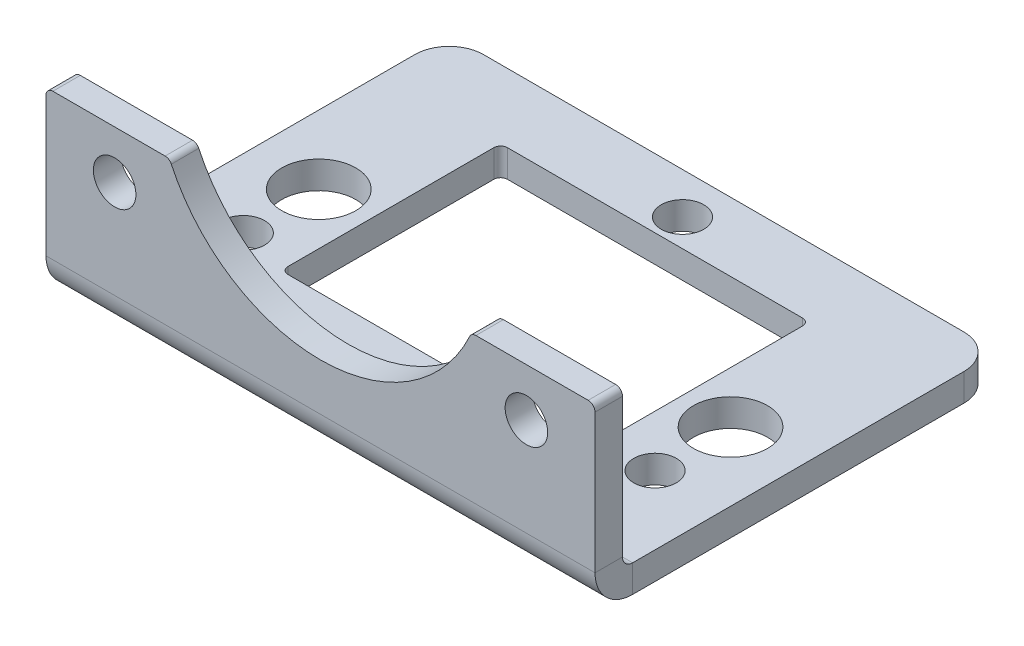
ISO-10303-21;
HEADER;
FILE_DESCRIPTION(('STEP AP214'),'2;1');
FILE_NAME('part.step','',(''),(''),'','','');
FILE_SCHEMA(('AUTOMOTIVE_DESIGN { 1 0 10303 214 1 1 1 1 }'));
ENDSEC;
DATA;
#1=APPLICATION_CONTEXT('core data for automotive mechanical design processes');
#2=APPLICATION_PROTOCOL_DEFINITION('international standard','automotive_design',2000,#1);
#3=PRODUCT_CONTEXT('',#1,'mechanical');
#4=PRODUCT('Part','Part','',(#3));
#5=PRODUCT_RELATED_PRODUCT_CATEGORY('part','',(#4));
#6=PRODUCT_DEFINITION_FORMATION('','',#4);
#7=PRODUCT_DEFINITION_CONTEXT('part definition',#1,'design');
#8=PRODUCT_DEFINITION('design','',#6,#7);
#9=PRODUCT_DEFINITION_SHAPE('','',#8);
#10=(LENGTH_UNIT() NAMED_UNIT(*) SI_UNIT(.MILLI.,.METRE.));
#11=(NAMED_UNIT(*) PLANE_ANGLE_UNIT() SI_UNIT($,.RADIAN.));
#12=(NAMED_UNIT(*) SI_UNIT($,.STERADIAN.) SOLID_ANGLE_UNIT());
#13=UNCERTAINTY_MEASURE_WITH_UNIT(LENGTH_MEASURE(1.E-05),#10,'distance_accuracy_value','');
#14=(GEOMETRIC_REPRESENTATION_CONTEXT(3) GLOBAL_UNCERTAINTY_ASSIGNED_CONTEXT((#13)) GLOBAL_UNIT_ASSIGNED_CONTEXT((#10,
#11,#12)) REPRESENTATION_CONTEXT('',''));
#15=CARTESIAN_POINT('',(0.,0.,0.));
#16=DIRECTION('',(0.,0.,1.));
#17=DIRECTION('',(1.,0.,0.));
#18=AXIS2_PLACEMENT_3D('',#15,#16,#17);
#19=CARTESIAN_POINT('',(-20.,-2.62732245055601,-10.627322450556));
#20=DIRECTION('',(-1.,0.,0.));
#21=DIRECTION('',(0.,1.,0.));
#22=AXIS2_PLACEMENT_3D('',#19,#20,#21);
#23=PLANE('',#22);
#24=DIRECTION('',(0.,1.,0.));
#25=VECTOR('',#24,1.);
#26=CARTESIAN_POINT('',(-20.,-2.62732245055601,-12.627322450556));
#27=LINE('',#26,#25);
#28=CARTESIAN_POINT('',(-20.,0.736600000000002,-12.627322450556));
#29=VERTEX_POINT('',#28);
#30=CARTESIAN_POINT('',(-20.,10.872677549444,-12.627322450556));
#31=VERTEX_POINT('',#30);
#32=EDGE_CURVE('E66',#29,#31,#27,.T.);
#33=ORIENTED_EDGE('',*,*,#32,.F.);
#34=DIRECTION('',(0.,0.,1.));
#35=VECTOR('',#34,1.);
#36=CARTESIAN_POINT('',(-20.,0.736600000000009,-10.627322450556));
#37=LINE('',#36,#35);
#38=CARTESIAN_POINT('',(-20.,0.736600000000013,-10.627322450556));
#39=VERTEX_POINT('',#38);
#40=EDGE_CURVE('E202',#29,#39,#37,.T.);
#41=ORIENTED_EDGE('',*,*,#40,.T.);
#42=DIRECTION('',(0.,1.,0.));
#43=VECTOR('',#42,1.);
#44=CARTESIAN_POINT('',(-20.,-15.877322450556,-10.6273224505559));
#45=LINE('',#44,#43);
#46=CARTESIAN_POINT('',(-20.,10.872677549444,-10.627322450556));
#47=VERTEX_POINT('',#46);
#48=EDGE_CURVE('E46',#39,#47,#45,.T.);
#49=ORIENTED_EDGE('',*,*,#48,.T.);
#50=DIRECTION('',(0.,0.,-1.));
#51=VECTOR('',#50,1.);
#52=CARTESIAN_POINT('',(-20.,10.872677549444,-10.627322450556));
#53=LINE('',#52,#51);
#54=EDGE_CURVE('E231',#47,#31,#53,.T.);
#55=ORIENTED_EDGE('',*,*,#54,.T.);
#56=EDGE_LOOP('',(#33,#41,#49,#55));
#57=FACE_BOUND('',#56,.T.);
#58=ADVANCED_FACE('F42',(#57),#23,.T.);
#59=CARTESIAN_POINT('',(20.,-15.877322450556,-10.6273224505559));
#60=DIRECTION('',(1.,0.,0.));
#61=DIRECTION('',(0.,-1.,0.));
#62=AXIS2_PLACEMENT_3D('',#59,#60,#61);
#63=PLANE('',#62);
#64=DIRECTION('',(0.,-1.,0.));
#65=VECTOR('',#64,1.);
#66=CARTESIAN_POINT('',(20.,-15.877322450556,-10.6273224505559));
#67=LINE('',#66,#65);
#68=CARTESIAN_POINT('',(20.,10.872677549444,-10.627322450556));
#69=VERTEX_POINT('',#68);
#70=CARTESIAN_POINT('',(20.,0.736600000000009,-10.627322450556));
#71=VERTEX_POINT('',#70);
#72=EDGE_CURVE('E222',#69,#71,#67,.T.);
#73=ORIENTED_EDGE('',*,*,#72,.T.);
#74=DIRECTION('',(0.,0.,-1.));
#75=VECTOR('',#74,1.);
#76=CARTESIAN_POINT('',(20.,0.736600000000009,-10.627322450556));
#77=LINE('',#76,#75);
#78=CARTESIAN_POINT('',(20.,0.736599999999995,-12.627322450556));
#79=VERTEX_POINT('',#78);
#80=EDGE_CURVE('E12',#71,#79,#77,.T.);
#81=ORIENTED_EDGE('',*,*,#80,.T.);
#82=DIRECTION('',(0.,-1.,0.));
#83=VECTOR('',#82,1.);
#84=CARTESIAN_POINT('',(20.,-15.877322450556,-12.6273224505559));
#85=LINE('',#84,#83);
#86=CARTESIAN_POINT('',(20.,10.872677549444,-12.627322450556));
#87=VERTEX_POINT('',#86);
#88=EDGE_CURVE('E59',#87,#79,#85,.T.);
#89=ORIENTED_EDGE('',*,*,#88,.F.);
#90=DIRECTION('',(0.,0.,-1.));
#91=VECTOR('',#90,1.);
#92=CARTESIAN_POINT('',(20.,10.872677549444,-10.627322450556));
#93=LINE('',#92,#91);
#94=EDGE_CURVE('E443',#69,#87,#93,.T.);
#95=ORIENTED_EDGE('',*,*,#94,.F.);
#96=EDGE_LOOP('',(#73,#81,#89,#95));
#97=FACE_BOUND('',#96,.T.);
#98=ADVANCED_FACE('F44',(#97),#63,.T.);
#99=CARTESIAN_POINT('',(-19.5,10.872677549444,-12.627322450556));
#100=DIRECTION('',(0.,0.,-1.));
#101=DIRECTION('',(0.,1.,0.));
#102=AXIS2_PLACEMENT_3D('',#99,#100,#101);
#103=PLANE('',#102);
#104=CARTESIAN_POINT('',(15.,7.87267754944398,-12.627322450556));
#105=DIRECTION('',(0.,0.,-1.));
#106=DIRECTION('',(0.,1.,0.));
#107=AXIS2_PLACEMENT_3D('',#104,#105,#106);
#108=CIRCLE('',#107,1.54999999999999);
#109=CARTESIAN_POINT('',(15.,9.42267754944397,-12.627322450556));
#110=VERTEX_POINT('',#109);
#111=EDGE_CURVE('E395',#110,#110,#108,.T.);
#112=ORIENTED_EDGE('',*,*,#111,.F.);
#113=EDGE_LOOP('',(#112));
#114=FACE_BOUND('',#113,.T.);
#115=CARTESIAN_POINT('',(-15.,7.87267754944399,-12.627322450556));
#116=DIRECTION('',(0.,0.,-1.));
#117=DIRECTION('',(0.,-1.,0.));
#118=AXIS2_PLACEMENT_3D('',#115,#116,#117);
#119=CIRCLE('',#118,1.54999999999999);
#120=CARTESIAN_POINT('',(-15.,6.322677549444,-12.627322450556));
#121=VERTEX_POINT('',#120);
#122=EDGE_CURVE('E252',#121,#121,#119,.T.);
#123=ORIENTED_EDGE('',*,*,#122,.F.);
#124=EDGE_LOOP('',(#123));
#125=FACE_BOUND('',#124,.T.);
#126=ORIENTED_EDGE('',*,*,#88,.T.);
#127=DIRECTION('',(-1.,0.,0.));
#128=VECTOR('',#127,1.);
#129=CARTESIAN_POINT('',(-19.5,0.736600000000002,-12.627322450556));
#130=LINE('',#129,#128);
#131=EDGE_CURVE('E51',#79,#29,#130,.T.);
#132=ORIENTED_EDGE('',*,*,#131,.T.);
#133=ORIENTED_EDGE('',*,*,#32,.T.);
#134=CARTESIAN_POINT('',(-19.5,10.872677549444,-12.627322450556));
#135=DIRECTION('',(0.,0.,-1.));
#136=DIRECTION('',(0.,1.,0.));
#137=AXIS2_PLACEMENT_3D('',#134,#135,#136);
#138=CIRCLE('',#137,0.499999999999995);
#139=CARTESIAN_POINT('',(-19.5,11.372677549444,-12.627322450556));
#140=VERTEX_POINT('',#139);
#141=EDGE_CURVE('E401',#31,#140,#138,.T.);
#142=ORIENTED_EDGE('',*,*,#141,.T.);
#143=DIRECTION('',(1.,0.,0.));
#144=VECTOR('',#143,1.);
#145=CARTESIAN_POINT('',(-19.5,11.372677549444,-12.627322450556));
#146=LINE('',#145,#144);
#147=CARTESIAN_POINT('',(-11.3227279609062,11.372677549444,-12.627322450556));
#148=VERTEX_POINT('',#147);
#149=EDGE_CURVE('E425',#140,#148,#146,.T.);
#150=ORIENTED_EDGE('',*,*,#149,.T.);
#151=CARTESIAN_POINT('',(-11.3227279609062,10.872677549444,-12.627322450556));
#152=DIRECTION('',(0.,0.,-1.));
#153=DIRECTION('',(0.,-1.,0.));
#154=AXIS2_PLACEMENT_3D('',#151,#152,#153);
#155=CIRCLE('',#154,0.500000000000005);
#156=CARTESIAN_POINT('',(-10.86981884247,11.0845108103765,-12.627322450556));
#157=VERTEX_POINT('',#156);
#158=EDGE_CURVE('E428',#148,#157,#155,.T.);
#159=ORIENTED_EDGE('',*,*,#158,.T.);
#160=CARTESIAN_POINT('',(0.,16.1685090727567,-12.6273224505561));
#161=DIRECTION('',(0.,0.,1.));
#162=DIRECTION('',(0.,-1.,0.));
#163=AXIS2_PLACEMENT_3D('',#160,#161,#162);
#164=CIRCLE('',#163,12.);
#165=CARTESIAN_POINT('',(10.86981884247,11.0845108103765,-12.627322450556));
#166=VERTEX_POINT('',#165);
#167=EDGE_CURVE('E431',#157,#166,#164,.T.);
#168=ORIENTED_EDGE('',*,*,#167,.T.);
#169=CARTESIAN_POINT('',(11.3227279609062,10.872677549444,-12.627322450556));
#170=DIRECTION('',(0.,0.,-1.));
#171=DIRECTION('',(0.,1.,0.));
#172=AXIS2_PLACEMENT_3D('',#169,#170,#171);
#173=CIRCLE('',#172,0.500000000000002);
#174=CARTESIAN_POINT('',(11.3227279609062,11.372677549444,-12.627322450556));
#175=VERTEX_POINT('',#174);
#176=EDGE_CURVE('E434',#166,#175,#173,.T.);
#177=ORIENTED_EDGE('',*,*,#176,.T.);
#178=DIRECTION('',(1.,0.,0.));
#179=VECTOR('',#178,1.);
#180=CARTESIAN_POINT('',(19.5,11.372677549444,-12.627322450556));
#181=LINE('',#180,#179);
#182=CARTESIAN_POINT('',(19.5,11.372677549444,-12.627322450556));
#183=VERTEX_POINT('',#182);
#184=EDGE_CURVE('E437',#175,#183,#181,.T.);
#185=ORIENTED_EDGE('',*,*,#184,.T.);
#186=CARTESIAN_POINT('',(19.5,10.872677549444,-12.627322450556));
#187=DIRECTION('',(0.,0.,-1.));
#188=DIRECTION('',(0.,-1.,0.));
#189=AXIS2_PLACEMENT_3D('',#186,#187,#188);
#190=CIRCLE('',#189,0.5);
#191=EDGE_CURVE('E440',#183,#87,#190,.T.);
#192=ORIENTED_EDGE('',*,*,#191,.T.);
#193=EDGE_LOOP('',(#126,#132,#133,#142,#150,#159,#168,#177,#185,#192));
#194=FACE_BOUND('',#193,.T.);
#195=ADVANCED_FACE('F459',(#114,#125,#194),#103,.T.);
#196=CARTESIAN_POINT('',(-19.5,10.872677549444,-10.627322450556));
#197=DIRECTION('',(0.,0.,-1.));
#198=DIRECTION('',(0.,1.,0.));
#199=AXIS2_PLACEMENT_3D('',#196,#197,#198);
#200=CYLINDRICAL_SURFACE('',#199,0.499999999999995);
#201=ORIENTED_EDGE('',*,*,#141,.F.);
#202=ORIENTED_EDGE('',*,*,#54,.F.);
#203=CARTESIAN_POINT('',(-19.5,10.872677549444,-10.627322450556));
#204=DIRECTION('',(0.,0.,-1.));
#205=DIRECTION('',(0.,1.,0.));
#206=AXIS2_PLACEMENT_3D('',#203,#204,#205);
#207=CIRCLE('',#206,0.499999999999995);
#208=CARTESIAN_POINT('',(-19.5,11.372677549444,-10.627322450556));
#209=VERTEX_POINT('',#208);
#210=EDGE_CURVE('E220',#47,#209,#207,.T.);
#211=ORIENTED_EDGE('',*,*,#210,.T.);
#212=DIRECTION('',(0.,0.,-1.));
#213=VECTOR('',#212,1.);
#214=CARTESIAN_POINT('',(-19.5,11.372677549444,-10.627322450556));
#215=LINE('',#214,#213);
#216=EDGE_CURVE('E221',#209,#140,#215,.T.);
#217=ORIENTED_EDGE('',*,*,#216,.T.);
#218=EDGE_LOOP('',(#201,#202,#211,#217));
#219=FACE_BOUND('',#218,.T.);
#220=ADVANCED_FACE('F463',(#219),#200,.T.);
#221=CARTESIAN_POINT('',(19.5,10.872677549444,-10.627322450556));
#222=DIRECTION('',(0.,0.,-1.));
#223=DIRECTION('',(0.,1.,0.));
#224=AXIS2_PLACEMENT_3D('',#221,#222,#223);
#225=CYLINDRICAL_SURFACE('',#224,0.5);
#226=ORIENTED_EDGE('',*,*,#191,.F.);
#227=DIRECTION('',(0.,0.,-1.));
#228=VECTOR('',#227,1.);
#229=CARTESIAN_POINT('',(19.5,11.372677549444,-10.627322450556));
#230=LINE('',#229,#228);
#231=CARTESIAN_POINT('',(19.5,11.372677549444,-10.627322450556));
#232=VERTEX_POINT('',#231);
#233=EDGE_CURVE('E446',#232,#183,#230,.T.);
#234=ORIENTED_EDGE('',*,*,#233,.F.);
#235=CARTESIAN_POINT('',(19.5,10.872677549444,-10.627322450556));
#236=DIRECTION('',(0.,0.,-1.));
#237=DIRECTION('',(0.,-1.,0.));
#238=AXIS2_PLACEMENT_3D('',#235,#236,#237);
#239=CIRCLE('',#238,0.5);
#240=EDGE_CURVE('E420',#232,#69,#239,.T.);
#241=ORIENTED_EDGE('',*,*,#240,.T.);
#242=ORIENTED_EDGE('',*,*,#94,.T.);
#243=EDGE_LOOP('',(#226,#234,#241,#242));
#244=FACE_BOUND('',#243,.T.);
#245=ADVANCED_FACE('F486',(#244),#225,.T.);
#246=CARTESIAN_POINT('',(19.5,11.372677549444,-10.627322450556));
#247=DIRECTION('',(0.,1.,0.));
#248=DIRECTION('',(1.,0.,0.));
#249=AXIS2_PLACEMENT_3D('',#246,#247,#248);
#250=PLANE('',#249);
#251=ORIENTED_EDGE('',*,*,#184,.F.);
#252=DIRECTION('',(0.,0.,-1.));
#253=VECTOR('',#252,1.);
#254=CARTESIAN_POINT('',(11.3227279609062,11.372677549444,-10.627322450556));
#255=LINE('',#254,#253);
#256=CARTESIAN_POINT('',(11.3227279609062,11.372677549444,-10.627322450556));
#257=VERTEX_POINT('',#256);
#258=EDGE_CURVE('E448',#257,#175,#255,.T.);
#259=ORIENTED_EDGE('',*,*,#258,.F.);
#260=DIRECTION('',(1.,0.,0.));
#261=VECTOR('',#260,1.);
#262=CARTESIAN_POINT('',(19.5,11.372677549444,-10.627322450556));
#263=LINE('',#262,#261);
#264=EDGE_CURVE('E417',#257,#232,#263,.T.);
#265=ORIENTED_EDGE('',*,*,#264,.T.);
#266=ORIENTED_EDGE('',*,*,#233,.T.);
#267=EDGE_LOOP('',(#251,#259,#265,#266));
#268=FACE_BOUND('',#267,.T.);
#269=ADVANCED_FACE('F482',(#268),#250,.T.);
#270=CARTESIAN_POINT('',(11.3227279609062,10.872677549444,-10.627322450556));
#271=DIRECTION('',(0.,0.,-1.));
#272=DIRECTION('',(0.,1.,0.));
#273=AXIS2_PLACEMENT_3D('',#270,#271,#272);
#274=CYLINDRICAL_SURFACE('',#273,0.500000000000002);
#275=ORIENTED_EDGE('',*,*,#176,.F.);
#276=DIRECTION('',(0.,0.,-1.));
#277=VECTOR('',#276,1.);
#278=CARTESIAN_POINT('',(10.86981884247,11.0845108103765,-10.627322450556));
#279=LINE('',#278,#277);
#280=CARTESIAN_POINT('',(10.86981884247,11.0845108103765,-10.627322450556));
#281=VERTEX_POINT('',#280);
#282=EDGE_CURVE('E450',#281,#166,#279,.T.);
#283=ORIENTED_EDGE('',*,*,#282,.F.);
#284=CARTESIAN_POINT('',(11.3227279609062,10.872677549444,-10.627322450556));
#285=DIRECTION('',(0.,0.,-1.));
#286=DIRECTION('',(0.,1.,0.));
#287=AXIS2_PLACEMENT_3D('',#284,#285,#286);
#288=CIRCLE('',#287,0.500000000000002);
#289=EDGE_CURVE('E414',#281,#257,#288,.T.);
#290=ORIENTED_EDGE('',*,*,#289,.T.);
#291=ORIENTED_EDGE('',*,*,#258,.T.);
#292=EDGE_LOOP('',(#275,#283,#290,#291));
#293=FACE_BOUND('',#292,.T.);
#294=ADVANCED_FACE('F478',(#293),#274,.T.);
#295=CARTESIAN_POINT('',(0.,16.1685090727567,-10.6273224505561));
#296=DIRECTION('',(0.,0.,-1.));
#297=DIRECTION('',(0.,1.,0.));
#298=AXIS2_PLACEMENT_3D('',#295,#296,#297);
#299=CYLINDRICAL_SURFACE('',#298,12.);
#300=ORIENTED_EDGE('',*,*,#167,.F.);
#301=DIRECTION('',(0.,0.,-1.));
#302=VECTOR('',#301,1.);
#303=CARTESIAN_POINT('',(-10.86981884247,11.0845108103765,-10.627322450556));
#304=LINE('',#303,#302);
#305=CARTESIAN_POINT('',(-10.86981884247,11.0845108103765,-10.627322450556));
#306=VERTEX_POINT('',#305);
#307=EDGE_CURVE('E452',#306,#157,#304,.T.);
#308=ORIENTED_EDGE('',*,*,#307,.F.);
#309=CARTESIAN_POINT('',(0.,16.1685090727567,-10.6273224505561));
#310=DIRECTION('',(0.,0.,1.));
#311=DIRECTION('',(0.,-1.,0.));
#312=AXIS2_PLACEMENT_3D('',#309,#310,#311);
#313=CIRCLE('',#312,12.);
#314=EDGE_CURVE('E411',#306,#281,#313,.T.);
#315=ORIENTED_EDGE('',*,*,#314,.T.);
#316=ORIENTED_EDGE('',*,*,#282,.T.);
#317=EDGE_LOOP('',(#300,#308,#315,#316));
#318=FACE_BOUND('',#317,.T.);
#319=ADVANCED_FACE('F474',(#318),#299,.F.);
#320=CARTESIAN_POINT('',(-11.3227279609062,10.872677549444,-10.627322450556));
#321=DIRECTION('',(0.,0.,-1.));
#322=DIRECTION('',(0.,1.,0.));
#323=AXIS2_PLACEMENT_3D('',#320,#321,#322);
#324=CYLINDRICAL_SURFACE('',#323,0.500000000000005);
#325=ORIENTED_EDGE('',*,*,#158,.F.);
#326=DIRECTION('',(0.,0.,-1.));
#327=VECTOR('',#326,1.);
#328=CARTESIAN_POINT('',(-11.3227279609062,11.372677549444,-10.627322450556));
#329=LINE('',#328,#327);
#330=CARTESIAN_POINT('',(-11.3227279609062,11.372677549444,-10.627322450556));
#331=VERTEX_POINT('',#330);
#332=EDGE_CURVE('E454',#331,#148,#329,.T.);
#333=ORIENTED_EDGE('',*,*,#332,.F.);
#334=CARTESIAN_POINT('',(-11.3227279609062,10.872677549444,-10.627322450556));
#335=DIRECTION('',(0.,0.,-1.));
#336=DIRECTION('',(0.,-1.,0.));
#337=AXIS2_PLACEMENT_3D('',#334,#335,#336);
#338=CIRCLE('',#337,0.500000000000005);
#339=EDGE_CURVE('E408',#331,#306,#338,.T.);
#340=ORIENTED_EDGE('',*,*,#339,.T.);
#341=ORIENTED_EDGE('',*,*,#307,.T.);
#342=EDGE_LOOP('',(#325,#333,#340,#341));
#343=FACE_BOUND('',#342,.T.);
#344=ADVANCED_FACE('F470',(#343),#324,.T.);
#345=CARTESIAN_POINT('',(-19.5,11.372677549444,-10.627322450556));
#346=DIRECTION('',(0.,1.,0.));
#347=DIRECTION('',(1.,0.,0.));
#348=AXIS2_PLACEMENT_3D('',#345,#346,#347);
#349=PLANE('',#348);
#350=ORIENTED_EDGE('',*,*,#149,.F.);
#351=ORIENTED_EDGE('',*,*,#216,.F.);
#352=DIRECTION('',(1.,0.,0.));
#353=VECTOR('',#352,1.);
#354=CARTESIAN_POINT('',(-19.5,11.372677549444,-10.627322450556));
#355=LINE('',#354,#353);
#356=EDGE_CURVE('E405',#209,#331,#355,.T.);
#357=ORIENTED_EDGE('',*,*,#356,.T.);
#358=ORIENTED_EDGE('',*,*,#332,.T.);
#359=EDGE_LOOP('',(#350,#351,#357,#358));
#360=FACE_BOUND('',#359,.T.);
#361=ADVANCED_FACE('F466',(#360),#349,.T.);
#362=CARTESIAN_POINT('',(-19.5,10.872677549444,-10.627322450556));
#363=DIRECTION('',(0.,0.,-1.));
#364=DIRECTION('',(0.,1.,0.));
#365=AXIS2_PLACEMENT_3D('',#362,#363,#364);
#366=PLANE('',#365);
#367=DIRECTION('',(-1.,0.,0.));
#368=VECTOR('',#367,1.);
#369=CARTESIAN_POINT('',(-19.5,0.736600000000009,-10.627322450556));
#370=LINE('',#369,#368);
#371=EDGE_CURVE('E209',#71,#39,#370,.T.);
#372=ORIENTED_EDGE('',*,*,#371,.F.);
#373=ORIENTED_EDGE('',*,*,#72,.F.);
#374=ORIENTED_EDGE('',*,*,#240,.F.);
#375=ORIENTED_EDGE('',*,*,#264,.F.);
#376=ORIENTED_EDGE('',*,*,#289,.F.);
#377=ORIENTED_EDGE('',*,*,#314,.F.);
#378=ORIENTED_EDGE('',*,*,#339,.F.);
#379=ORIENTED_EDGE('',*,*,#356,.F.);
#380=ORIENTED_EDGE('',*,*,#210,.F.);
#381=ORIENTED_EDGE('',*,*,#48,.F.);
#382=EDGE_LOOP('',(#372,#373,#374,#375,#376,#377,#378,#379,#380,#381));
#383=FACE_BOUND('',#382,.T.);
#384=CARTESIAN_POINT('',(-15.,7.87267754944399,-10.627322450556));
#385=DIRECTION('',(0.,0.,-1.));
#386=DIRECTION('',(0.,-1.,0.));
#387=AXIS2_PLACEMENT_3D('',#384,#385,#386);
#388=CIRCLE('',#387,1.54999999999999);
#389=CARTESIAN_POINT('',(-15.,6.32267754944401,-10.627322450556));
#390=VERTEX_POINT('',#389);
#391=EDGE_CURVE('E392',#390,#390,#388,.T.);
#392=ORIENTED_EDGE('',*,*,#391,.T.);
#393=EDGE_LOOP('',(#392));
#394=FACE_BOUND('',#393,.T.);
#395=CARTESIAN_POINT('',(15.,7.87267754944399,-10.627322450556));
#396=DIRECTION('',(0.,0.,-1.));
#397=DIRECTION('',(0.,1.,0.));
#398=AXIS2_PLACEMENT_3D('',#395,#396,#397);
#399=CIRCLE('',#398,1.54999999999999);
#400=CARTESIAN_POINT('',(15.,9.42267754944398,-10.627322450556));
#401=VERTEX_POINT('',#400);
#402=EDGE_CURVE('E398',#401,#401,#399,.T.);
#403=ORIENTED_EDGE('',*,*,#402,.T.);
#404=EDGE_LOOP('',(#403));
#405=FACE_BOUND('',#404,.T.);
#406=ADVANCED_FACE('F214',(#383,#394,#405),#366,.F.);
#407=CARTESIAN_POINT('',(15.,7.87267754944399,-10.627322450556));
#408=DIRECTION('',(0.,0.,-1.));
#409=DIRECTION('',(0.,1.,0.));
#410=AXIS2_PLACEMENT_3D('',#407,#408,#409);
#411=CYLINDRICAL_SURFACE('',#410,1.54999999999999);
#412=ORIENTED_EDGE('',*,*,#402,.F.);
#413=EDGE_LOOP('',(#412));
#414=FACE_BOUND('',#413,.T.);
#415=ORIENTED_EDGE('',*,*,#111,.T.);
#416=EDGE_LOOP('',(#415));
#417=FACE_BOUND('',#416,.T.);
#418=ADVANCED_FACE('F548',(#414,#417),#411,.F.);
#419=CARTESIAN_POINT('',(-15.,7.87267754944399,-10.627322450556));
#420=DIRECTION('',(0.,0.,-1.));
#421=DIRECTION('',(0.,1.,0.));
#422=AXIS2_PLACEMENT_3D('',#419,#420,#421);
#423=CYLINDRICAL_SURFACE('',#422,1.54999999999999);
#424=ORIENTED_EDGE('',*,*,#391,.F.);
#425=EDGE_LOOP('',(#424));
#426=FACE_BOUND('',#425,.T.);
#427=ORIENTED_EDGE('',*,*,#122,.T.);
#428=EDGE_LOOP('',(#427));
#429=FACE_BOUND('',#428,.T.);
#430=ADVANCED_FACE('F546',(#426,#429),#423,.F.);
#431=CARTESIAN_POINT('',(17.5,-2.,-37.5));
#432=DIRECTION('',(0.,1.,0.));
#433=DIRECTION('',(0.,0.,1.));
#434=AXIS2_PLACEMENT_3D('',#431,#432,#433);
#435=CYLINDRICAL_SURFACE('',#434,2.5);
#436=CARTESIAN_POINT('',(17.5,0.,-37.5));
#437=DIRECTION('',(0.,1.,0.));
#438=DIRECTION('',(0.,0.,1.));
#439=AXIS2_PLACEMENT_3D('',#436,#437,#438);
#440=CIRCLE('',#439,2.5);
#441=CARTESIAN_POINT('',(20.,0.,-37.5));
#442=VERTEX_POINT('',#441);
#443=CARTESIAN_POINT('',(17.5,0.,-40.));
#444=VERTEX_POINT('',#443);
#445=EDGE_CURVE('E263',#442,#444,#440,.T.);
#446=ORIENTED_EDGE('',*,*,#445,.F.);
#447=DIRECTION('',(0.,1.,0.));
#448=VECTOR('',#447,1.);
#449=CARTESIAN_POINT('',(20.,-2.,-37.5));
#450=LINE('',#449,#448);
#451=CARTESIAN_POINT('',(20.,-2.,-37.5));
#452=VERTEX_POINT('',#451);
#453=EDGE_CURVE('E249',#452,#442,#450,.T.);
#454=ORIENTED_EDGE('',*,*,#453,.F.);
#455=CARTESIAN_POINT('',(17.5,-2.,-37.5));
#456=DIRECTION('',(0.,1.,0.));
#457=DIRECTION('',(0.,0.,1.));
#458=AXIS2_PLACEMENT_3D('',#455,#456,#457);
#459=CIRCLE('',#458,2.5);
#460=CARTESIAN_POINT('',(17.5,-2.,-40.));
#461=VERTEX_POINT('',#460);
#462=EDGE_CURVE('E386',#452,#461,#459,.T.);
#463=ORIENTED_EDGE('',*,*,#462,.T.);
#464=DIRECTION('',(0.,1.,0.));
#465=VECTOR('',#464,1.);
#466=CARTESIAN_POINT('',(17.5,-2.,-40.));
#467=LINE('',#466,#465);
#468=EDGE_CURVE('E384',#461,#444,#467,.T.);
#469=ORIENTED_EDGE('',*,*,#468,.T.);
#470=EDGE_LOOP('',(#446,#454,#463,#469));
#471=FACE_BOUND('',#470,.T.);
#472=ADVANCED_FACE('F513',(#471),#435,.T.);
#473=CARTESIAN_POINT('',(-17.5,-2.,-40.));
#474=DIRECTION('',(0.,0.,-1.));
#475=DIRECTION('',(-1.,0.,0.));
#476=AXIS2_PLACEMENT_3D('',#473,#474,#475);
#477=PLANE('',#476);
#478=DIRECTION('',(-1.,0.,0.));
#479=VECTOR('',#478,1.);
#480=CARTESIAN_POINT('',(-17.5,0.,-40.));
#481=LINE('',#480,#479);
#482=CARTESIAN_POINT('',(-17.5,0.,-40.));
#483=VERTEX_POINT('',#482);
#484=EDGE_CURVE('E260',#444,#483,#481,.T.);
#485=ORIENTED_EDGE('',*,*,#484,.F.);
#486=ORIENTED_EDGE('',*,*,#468,.F.);
#487=DIRECTION('',(-1.,0.,0.));
#488=VECTOR('',#487,1.);
#489=CARTESIAN_POINT('',(-17.5,-2.,-40.));
#490=LINE('',#489,#488);
#491=CARTESIAN_POINT('',(-17.5,-2.,-40.));
#492=VERTEX_POINT('',#491);
#493=EDGE_CURVE('E381',#461,#492,#490,.T.);
#494=ORIENTED_EDGE('',*,*,#493,.T.);
#495=DIRECTION('',(0.,1.,0.));
#496=VECTOR('',#495,1.);
#497=CARTESIAN_POINT('',(-17.5,-2.,-40.));
#498=LINE('',#497,#496);
#499=EDGE_CURVE('E379',#492,#483,#498,.T.);
#500=ORIENTED_EDGE('',*,*,#499,.T.);
#501=EDGE_LOOP('',(#485,#486,#494,#500));
#502=FACE_BOUND('',#501,.T.);
#503=ADVANCED_FACE('F516',(#502),#477,.T.);
#504=CARTESIAN_POINT('',(-17.5,-2.,-37.5));
#505=DIRECTION('',(0.,1.,0.));
#506=DIRECTION('',(0.,0.,1.));
#507=AXIS2_PLACEMENT_3D('',#504,#505,#506);
#508=CYLINDRICAL_SURFACE('',#507,2.5);
#509=CARTESIAN_POINT('',(-17.5,0.,-37.5));
#510=DIRECTION('',(0.,1.,0.));
#511=DIRECTION('',(0.,0.,-1.));
#512=AXIS2_PLACEMENT_3D('',#509,#510,#511);
#513=CIRCLE('',#512,2.5);
#514=CARTESIAN_POINT('',(-20.,0.,-37.5));
#515=VERTEX_POINT('',#514);
#516=EDGE_CURVE('E257',#483,#515,#513,.T.);
#517=ORIENTED_EDGE('',*,*,#516,.F.);
#518=ORIENTED_EDGE('',*,*,#499,.F.);
#519=CARTESIAN_POINT('',(-17.5,-2.,-37.5));
#520=DIRECTION('',(0.,1.,0.));
#521=DIRECTION('',(0.,0.,-1.));
#522=AXIS2_PLACEMENT_3D('',#519,#520,#521);
#523=CIRCLE('',#522,2.5);
#524=CARTESIAN_POINT('',(-20.,-2.,-37.5));
#525=VERTEX_POINT('',#524);
#526=EDGE_CURVE('E376',#492,#525,#523,.T.);
#527=ORIENTED_EDGE('',*,*,#526,.T.);
#528=DIRECTION('',(0.,1.,0.));
#529=VECTOR('',#528,1.);
#530=CARTESIAN_POINT('',(-20.,-2.,-37.5));
#531=LINE('',#530,#529);
#532=EDGE_CURVE('E373',#525,#515,#531,.T.);
#533=ORIENTED_EDGE('',*,*,#532,.T.);
#534=EDGE_LOOP('',(#517,#518,#527,#533));
#535=FACE_BOUND('',#534,.T.);
#536=ADVANCED_FACE('F518',(#535),#508,.T.);
#537=CARTESIAN_POINT('',(0.,-2.,-16.));
#538=DIRECTION('',(0.,1.,0.));
#539=DIRECTION('',(0.,0.,1.));
#540=AXIS2_PLACEMENT_3D('',#537,#538,#539);
#541=CYLINDRICAL_SURFACE('',#540,1.55);
#542=CARTESIAN_POINT('',(0.,-2.,-16.));
#543=DIRECTION('',(0.,1.,0.));
#544=DIRECTION('',(0.,0.,1.));
#545=AXIS2_PLACEMENT_3D('',#542,#543,#544);
#546=CIRCLE('',#545,1.55);
#547=CARTESIAN_POINT('',(0.,-2.,-14.45));
#548=VERTEX_POINT('',#547);
#549=EDGE_CURVE('E273',#548,#548,#546,.T.);
#550=ORIENTED_EDGE('',*,*,#549,.F.);
#551=EDGE_LOOP('',(#550));
#552=FACE_BOUND('',#551,.T.);
#553=CARTESIAN_POINT('',(0.,0.,-16.));
#554=DIRECTION('',(0.,1.,0.));
#555=DIRECTION('',(0.,0.,1.));
#556=AXIS2_PLACEMENT_3D('',#553,#554,#555);
#557=CIRCLE('',#556,1.55);
#558=CARTESIAN_POINT('',(0.,0.,-14.45));
#559=VERTEX_POINT('',#558);
#560=EDGE_CURVE('E370',#559,#559,#557,.T.);
#561=ORIENTED_EDGE('',*,*,#560,.T.);
#562=EDGE_LOOP('',(#561));
#563=FACE_BOUND('',#562,.T.);
#564=ADVANCED_FACE('F520',(#552,#563),#541,.F.);
#565=CARTESIAN_POINT('',(0.,-2.,-37.));
#566=DIRECTION('',(0.,1.,0.));
#567=DIRECTION('',(0.,0.,1.));
#568=AXIS2_PLACEMENT_3D('',#565,#566,#567);
#569=CYLINDRICAL_SURFACE('',#568,1.55);
#570=CARTESIAN_POINT('',(0.,-2.,-37.));
#571=DIRECTION('',(0.,1.,0.));
#572=DIRECTION('',(0.,0.,1.));
#573=AXIS2_PLACEMENT_3D('',#570,#571,#572);
#574=CIRCLE('',#573,1.55);
#575=CARTESIAN_POINT('',(0.,-2.,-35.45));
#576=VERTEX_POINT('',#575);
#577=EDGE_CURVE('E276',#576,#576,#574,.T.);
#578=ORIENTED_EDGE('',*,*,#577,.F.);
#579=EDGE_LOOP('',(#578));
#580=FACE_BOUND('',#579,.T.);
#581=CARTESIAN_POINT('',(0.,0.,-37.));
#582=DIRECTION('',(0.,1.,0.));
#583=DIRECTION('',(0.,0.,1.));
#584=AXIS2_PLACEMENT_3D('',#581,#582,#583);
#585=CIRCLE('',#584,1.55);
#586=CARTESIAN_POINT('',(0.,0.,-35.45));
#587=VERTEX_POINT('',#586);
#588=EDGE_CURVE('E367',#587,#587,#585,.T.);
#589=ORIENTED_EDGE('',*,*,#588,.T.);
#590=EDGE_LOOP('',(#589));
#591=FACE_BOUND('',#590,.T.);
#592=ADVANCED_FACE('F526',(#580,#591),#569,.F.);
#593=CARTESIAN_POINT('',(-15.,-2.,-25.5));
#594=DIRECTION('',(0.,1.,0.));
#595=DIRECTION('',(0.,0.,1.));
#596=AXIS2_PLACEMENT_3D('',#593,#594,#595);
#597=CYLINDRICAL_SURFACE('',#596,2.7);
#598=CARTESIAN_POINT('',(-15.,-2.,-25.5));
#599=DIRECTION('',(0.,1.,0.));
#600=DIRECTION('',(0.,0.,-1.));
#601=AXIS2_PLACEMENT_3D('',#598,#599,#600);
#602=CIRCLE('',#601,2.7);
#603=CARTESIAN_POINT('',(-15.,-2.,-28.2));
#604=VERTEX_POINT('',#603);
#605=EDGE_CURVE('E279',#604,#604,#602,.T.);
#606=ORIENTED_EDGE('',*,*,#605,.F.);
#607=EDGE_LOOP('',(#606));
#608=FACE_BOUND('',#607,.T.);
#609=CARTESIAN_POINT('',(-15.,0.,-25.5));
#610=DIRECTION('',(0.,1.,0.));
#611=DIRECTION('',(0.,0.,-1.));
#612=AXIS2_PLACEMENT_3D('',#609,#610,#611);
#613=CIRCLE('',#612,2.7);
#614=CARTESIAN_POINT('',(-15.,0.,-28.2));
#615=VERTEX_POINT('',#614);
#616=EDGE_CURVE('E364',#615,#615,#613,.T.);
#617=ORIENTED_EDGE('',*,*,#616,.T.);
#618=EDGE_LOOP('',(#617));
#619=FACE_BOUND('',#618,.T.);
#620=ADVANCED_FACE('F626',(#608,#619),#597,.F.);
#621=CARTESIAN_POINT('',(-15.,-2.,-20.));
#622=DIRECTION('',(0.,1.,0.));
#623=DIRECTION('',(0.,0.,1.));
#624=AXIS2_PLACEMENT_3D('',#621,#622,#623);
#625=CYLINDRICAL_SURFACE('',#624,1.55);
#626=CARTESIAN_POINT('',(-15.,-2.,-20.));
#627=DIRECTION('',(0.,1.,0.));
#628=DIRECTION('',(0.,0.,-1.));
#629=AXIS2_PLACEMENT_3D('',#626,#627,#628);
#630=CIRCLE('',#629,1.55);
#631=CARTESIAN_POINT('',(-15.,-2.,-21.55));
#632=VERTEX_POINT('',#631);
#633=EDGE_CURVE('E282',#632,#632,#630,.T.);
#634=ORIENTED_EDGE('',*,*,#633,.F.);
#635=EDGE_LOOP('',(#634));
#636=FACE_BOUND('',#635,.T.);
#637=CARTESIAN_POINT('',(-15.,0.,-20.));
#638=DIRECTION('',(0.,1.,0.));
#639=DIRECTION('',(0.,0.,-1.));
#640=AXIS2_PLACEMENT_3D('',#637,#638,#639);
#641=CIRCLE('',#640,1.55);
#642=CARTESIAN_POINT('',(-15.,0.,-21.55));
#643=VERTEX_POINT('',#642);
#644=EDGE_CURVE('E361',#643,#643,#641,.T.);
#645=ORIENTED_EDGE('',*,*,#644,.T.);
#646=EDGE_LOOP('',(#645));
#647=FACE_BOUND('',#646,.T.);
#648=ADVANCED_FACE('F637',(#636,#647),#625,.F.);
#649=CARTESIAN_POINT('',(15.,-2.,-20.));
#650=DIRECTION('',(0.,1.,0.));
#651=DIRECTION('',(0.,0.,1.));
#652=AXIS2_PLACEMENT_3D('',#649,#650,#651);
#653=CYLINDRICAL_SURFACE('',#652,1.55);
#654=CARTESIAN_POINT('',(15.,-2.,-20.));
#655=DIRECTION('',(0.,1.,0.));
#656=DIRECTION('',(0.,0.,1.));
#657=AXIS2_PLACEMENT_3D('',#654,#655,#656);
#658=CIRCLE('',#657,1.55);
#659=CARTESIAN_POINT('',(15.,-2.,-18.45));
#660=VERTEX_POINT('',#659);
#661=EDGE_CURVE('E285',#660,#660,#658,.T.);
#662=ORIENTED_EDGE('',*,*,#661,.F.);
#663=EDGE_LOOP('',(#662));
#664=FACE_BOUND('',#663,.T.);
#665=CARTESIAN_POINT('',(15.,0.,-20.));
#666=DIRECTION('',(0.,1.,0.));
#667=DIRECTION('',(0.,0.,1.));
#668=AXIS2_PLACEMENT_3D('',#665,#666,#667);
#669=CIRCLE('',#668,1.55);
#670=CARTESIAN_POINT('',(15.,0.,-18.45));
#671=VERTEX_POINT('',#670);
#672=EDGE_CURVE('E358',#671,#671,#669,.T.);
#673=ORIENTED_EDGE('',*,*,#672,.T.);
#674=EDGE_LOOP('',(#673));
#675=FACE_BOUND('',#674,.T.);
#676=ADVANCED_FACE('F649',(#664,#675),#653,.F.);
#677=CARTESIAN_POINT('',(15.,-2.,-25.5));
#678=DIRECTION('',(0.,1.,0.));
#679=DIRECTION('',(0.,0.,1.));
#680=AXIS2_PLACEMENT_3D('',#677,#678,#679);
#681=CYLINDRICAL_SURFACE('',#680,2.7);
#682=CARTESIAN_POINT('',(15.,-2.,-25.5));
#683=DIRECTION('',(0.,1.,0.));
#684=DIRECTION('',(0.,0.,1.));
#685=AXIS2_PLACEMENT_3D('',#682,#683,#684);
#686=CIRCLE('',#685,2.7);
#687=CARTESIAN_POINT('',(15.,-2.,-22.8));
#688=VERTEX_POINT('',#687);
#689=EDGE_CURVE('E288',#688,#688,#686,.T.);
#690=ORIENTED_EDGE('',*,*,#689,.F.);
#691=EDGE_LOOP('',(#690));
#692=FACE_BOUND('',#691,.T.);
#693=CARTESIAN_POINT('',(15.,0.,-25.5));
#694=DIRECTION('',(0.,1.,0.));
#695=DIRECTION('',(0.,0.,1.));
#696=AXIS2_PLACEMENT_3D('',#693,#694,#695);
#697=CIRCLE('',#696,2.7);
#698=CARTESIAN_POINT('',(15.,0.,-22.8));
#699=VERTEX_POINT('',#698);
#700=EDGE_CURVE('E355',#699,#699,#697,.T.);
#701=ORIENTED_EDGE('',*,*,#700,.T.);
#702=EDGE_LOOP('',(#701));
#703=FACE_BOUND('',#702,.T.);
#704=ADVANCED_FACE('F661',(#692,#703),#681,.F.);
#705=CARTESIAN_POINT('',(10.75,-2.,-34.5));
#706=DIRECTION('',(0.,1.,0.));
#707=DIRECTION('',(0.,0.,1.));
#708=AXIS2_PLACEMENT_3D('',#705,#706,#707);
#709=CYLINDRICAL_SURFACE('',#708,0.499999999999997);
#710=CARTESIAN_POINT('',(10.75,0.,-34.5));
#711=DIRECTION('',(0.,1.,0.));
#712=DIRECTION('',(0.,0.,1.));
#713=AXIS2_PLACEMENT_3D('',#710,#711,#712);
#714=CIRCLE('',#713,0.499999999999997);
#715=CARTESIAN_POINT('',(11.25,0.,-34.5));
#716=VERTEX_POINT('',#715);
#717=CARTESIAN_POINT('',(10.75,0.,-35.));
#718=VERTEX_POINT('',#717);
#719=EDGE_CURVE('E352',#716,#718,#714,.T.);
#720=ORIENTED_EDGE('',*,*,#719,.T.);
#721=DIRECTION('',(0.,1.,0.));
#722=VECTOR('',#721,1.);
#723=CARTESIAN_POINT('',(10.75,-2.,-35.));
#724=LINE('',#723,#722);
#725=CARTESIAN_POINT('',(10.75,-2.,-35.));
#726=VERTEX_POINT('',#725);
#727=EDGE_CURVE('E315',#726,#718,#724,.T.);
#728=ORIENTED_EDGE('',*,*,#727,.F.);
#729=CARTESIAN_POINT('',(10.75,-2.,-34.5));
#730=DIRECTION('',(0.,1.,0.));
#731=DIRECTION('',(0.,0.,1.));
#732=AXIS2_PLACEMENT_3D('',#729,#730,#731);
#733=CIRCLE('',#732,0.499999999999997);
#734=CARTESIAN_POINT('',(11.25,-2.,-34.5));
#735=VERTEX_POINT('',#734);
#736=EDGE_CURVE('E291',#735,#726,#733,.T.);
#737=ORIENTED_EDGE('',*,*,#736,.F.);
#738=DIRECTION('',(0.,1.,0.));
#739=VECTOR('',#738,1.);
#740=CARTESIAN_POINT('',(11.25,-2.,-34.5));
#741=LINE('',#740,#739);
#742=EDGE_CURVE('E350',#735,#716,#741,.T.);
#743=ORIENTED_EDGE('',*,*,#742,.T.);
#744=EDGE_LOOP('',(#720,#728,#737,#743));
#745=FACE_BOUND('',#744,.T.);
#746=ADVANCED_FACE('F673',(#745),#709,.F.);
#747=CARTESIAN_POINT('',(11.25,-2.,-34.5));
#748=DIRECTION('',(1.,0.,0.));
#749=DIRECTION('',(0.,0.,-1.));
#750=AXIS2_PLACEMENT_3D('',#747,#748,#749);
#751=PLANE('',#750);
#752=DIRECTION('',(0.,0.,-1.));
#753=VECTOR('',#752,1.);
#754=CARTESIAN_POINT('',(11.25,0.,-34.5));
#755=LINE('',#754,#753);
#756=CARTESIAN_POINT('',(11.25,0.,-19.5));
#757=VERTEX_POINT('',#756);
#758=EDGE_CURVE('E347',#757,#716,#755,.T.);
#759=ORIENTED_EDGE('',*,*,#758,.T.);
#760=ORIENTED_EDGE('',*,*,#742,.F.);
#761=DIRECTION('',(0.,0.,-1.));
#762=VECTOR('',#761,1.);
#763=CARTESIAN_POINT('',(11.25,-2.,-34.5));
#764=LINE('',#763,#762);
#765=CARTESIAN_POINT('',(11.25,-2.,-19.5));
#766=VERTEX_POINT('',#765);
#767=EDGE_CURVE('E294',#766,#735,#764,.T.);
#768=ORIENTED_EDGE('',*,*,#767,.F.);
#769=DIRECTION('',(0.,1.,0.));
#770=VECTOR('',#769,1.);
#771=CARTESIAN_POINT('',(11.25,-2.,-19.5));
#772=LINE('',#771,#770);
#773=EDGE_CURVE('E345',#766,#757,#772,.T.);
#774=ORIENTED_EDGE('',*,*,#773,.T.);
#775=EDGE_LOOP('',(#759,#760,#768,#774));
#776=FACE_BOUND('',#775,.T.);
#777=ADVANCED_FACE('F684',(#776),#751,.F.);
#778=CARTESIAN_POINT('',(10.75,-2.,-19.5));
#779=DIRECTION('',(0.,1.,0.));
#780=DIRECTION('',(0.,0.,1.));
#781=AXIS2_PLACEMENT_3D('',#778,#779,#780);
#782=CYLINDRICAL_SURFACE('',#781,0.499999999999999);
#783=CARTESIAN_POINT('',(10.75,0.,-19.5));
#784=DIRECTION('',(0.,1.,0.));
#785=DIRECTION('',(0.,0.,-1.));
#786=AXIS2_PLACEMENT_3D('',#783,#784,#785);
#787=CIRCLE('',#786,0.499999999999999);
#788=CARTESIAN_POINT('',(10.75,0.,-19.));
#789=VERTEX_POINT('',#788);
#790=EDGE_CURVE('E342',#789,#757,#787,.T.);
#791=ORIENTED_EDGE('',*,*,#790,.T.);
#792=ORIENTED_EDGE('',*,*,#773,.F.);
#793=CARTESIAN_POINT('',(10.75,-2.,-19.5));
#794=DIRECTION('',(0.,1.,0.));
#795=DIRECTION('',(0.,0.,-1.));
#796=AXIS2_PLACEMENT_3D('',#793,#794,#795);
#797=CIRCLE('',#796,0.499999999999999);
#798=CARTESIAN_POINT('',(10.75,-2.,-19.));
#799=VERTEX_POINT('',#798);
#800=EDGE_CURVE('E297',#799,#766,#797,.T.);
#801=ORIENTED_EDGE('',*,*,#800,.F.);
#802=DIRECTION('',(0.,1.,0.));
#803=VECTOR('',#802,1.);
#804=CARTESIAN_POINT('',(10.75,-2.,-19.));
#805=LINE('',#804,#803);
#806=EDGE_CURVE('E340',#799,#789,#805,.T.);
#807=ORIENTED_EDGE('',*,*,#806,.T.);
#808=EDGE_LOOP('',(#791,#792,#801,#807));
#809=FACE_BOUND('',#808,.T.);
#810=ADVANCED_FACE('F695',(#809),#782,.F.);
#811=CARTESIAN_POINT('',(-10.75,-2.,-19.));
#812=DIRECTION('',(0.,0.,1.));
#813=DIRECTION('',(1.,0.,0.));
#814=AXIS2_PLACEMENT_3D('',#811,#812,#813);
#815=PLANE('',#814);
#816=DIRECTION('',(1.,0.,0.));
#817=VECTOR('',#816,1.);
#818=CARTESIAN_POINT('',(-10.75,0.,-19.));
#819=LINE('',#818,#817);
#820=CARTESIAN_POINT('',(-10.75,0.,-19.));
#821=VERTEX_POINT('',#820);
#822=EDGE_CURVE('E337',#821,#789,#819,.T.);
#823=ORIENTED_EDGE('',*,*,#822,.T.);
#824=ORIENTED_EDGE('',*,*,#806,.F.);
#825=DIRECTION('',(1.,0.,0.));
#826=VECTOR('',#825,1.);
#827=CARTESIAN_POINT('',(-10.75,-2.,-19.));
#828=LINE('',#827,#826);
#829=CARTESIAN_POINT('',(-10.75,-2.,-19.));
#830=VERTEX_POINT('',#829);
#831=EDGE_CURVE('E300',#830,#799,#828,.T.);
#832=ORIENTED_EDGE('',*,*,#831,.F.);
#833=DIRECTION('',(0.,1.,0.));
#834=VECTOR('',#833,1.);
#835=CARTESIAN_POINT('',(-10.75,-2.,-19.));
#836=LINE('',#835,#834);
#837=EDGE_CURVE('E335',#830,#821,#836,.T.);
#838=ORIENTED_EDGE('',*,*,#837,.T.);
#839=EDGE_LOOP('',(#823,#824,#832,#838));
#840=FACE_BOUND('',#839,.T.);
#841=ADVANCED_FACE('F706',(#840),#815,.F.);
#842=CARTESIAN_POINT('',(-10.75,-2.,-19.5));
#843=DIRECTION('',(0.,1.,0.));
#844=DIRECTION('',(0.,0.,1.));
#845=AXIS2_PLACEMENT_3D('',#842,#843,#844);
#846=CYLINDRICAL_SURFACE('',#845,0.499999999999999);
#847=CARTESIAN_POINT('',(-10.75,0.,-19.5));
#848=DIRECTION('',(0.,1.,0.));
#849=DIRECTION('',(0.,0.,1.));
#850=AXIS2_PLACEMENT_3D('',#847,#848,#849);
#851=CIRCLE('',#850,0.499999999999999);
#852=CARTESIAN_POINT('',(-11.25,0.,-19.5));
#853=VERTEX_POINT('',#852);
#854=EDGE_CURVE('E332',#853,#821,#851,.T.);
#855=ORIENTED_EDGE('',*,*,#854,.T.);
#856=ORIENTED_EDGE('',*,*,#837,.F.);
#857=CARTESIAN_POINT('',(-10.75,-2.,-19.5));
#858=DIRECTION('',(0.,1.,0.));
#859=DIRECTION('',(0.,0.,1.));
#860=AXIS2_PLACEMENT_3D('',#857,#858,#859);
#861=CIRCLE('',#860,0.499999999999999);
#862=CARTESIAN_POINT('',(-11.25,-2.,-19.5));
#863=VERTEX_POINT('',#862);
#864=EDGE_CURVE('E303',#863,#830,#861,.T.);
#865=ORIENTED_EDGE('',*,*,#864,.F.);
#866=DIRECTION('',(0.,1.,0.));
#867=VECTOR('',#866,1.);
#868=CARTESIAN_POINT('',(-11.25,-2.,-19.5));
#869=LINE('',#868,#867);
#870=EDGE_CURVE('E330',#863,#853,#869,.T.);
#871=ORIENTED_EDGE('',*,*,#870,.T.);
#872=EDGE_LOOP('',(#855,#856,#865,#871));
#873=FACE_BOUND('',#872,.T.);
#874=ADVANCED_FACE('F717',(#873),#846,.F.);
#875=CARTESIAN_POINT('',(-11.25,-2.,-34.5));
#876=DIRECTION('',(-1.,0.,0.));
#877=DIRECTION('',(0.,0.,1.));
#878=AXIS2_PLACEMENT_3D('',#875,#876,#877);
#879=PLANE('',#878);
#880=DIRECTION('',(0.,0.,1.));
#881=VECTOR('',#880,1.);
#882=CARTESIAN_POINT('',(-11.25,0.,-34.5));
#883=LINE('',#882,#881);
#884=CARTESIAN_POINT('',(-11.25,0.,-34.5));
#885=VERTEX_POINT('',#884);
#886=EDGE_CURVE('E327',#885,#853,#883,.T.);
#887=ORIENTED_EDGE('',*,*,#886,.T.);
#888=ORIENTED_EDGE('',*,*,#870,.F.);
#889=DIRECTION('',(0.,0.,1.));
#890=VECTOR('',#889,1.);
#891=CARTESIAN_POINT('',(-11.25,-2.,-34.5));
#892=LINE('',#891,#890);
#893=CARTESIAN_POINT('',(-11.25,-2.,-34.5));
#894=VERTEX_POINT('',#893);
#895=EDGE_CURVE('E306',#894,#863,#892,.T.);
#896=ORIENTED_EDGE('',*,*,#895,.F.);
#897=DIRECTION('',(0.,1.,0.));
#898=VECTOR('',#897,1.);
#899=CARTESIAN_POINT('',(-11.25,-2.,-34.5));
#900=LINE('',#899,#898);
#901=EDGE_CURVE('E324',#894,#885,#900,.T.);
#902=ORIENTED_EDGE('',*,*,#901,.T.);
#903=EDGE_LOOP('',(#887,#888,#896,#902));
#904=FACE_BOUND('',#903,.T.);
#905=ADVANCED_FACE('F728',(#904),#879,.F.);
#906=CARTESIAN_POINT('',(-10.75,-2.,-34.5));
#907=DIRECTION('',(0.,1.,0.));
#908=DIRECTION('',(0.,0.,1.));
#909=AXIS2_PLACEMENT_3D('',#906,#907,#908);
#910=CYLINDRICAL_SURFACE('',#909,0.499999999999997);
#911=CARTESIAN_POINT('',(-10.75,0.,-34.5));
#912=DIRECTION('',(0.,1.,0.));
#913=DIRECTION('',(0.,0.,-1.));
#914=AXIS2_PLACEMENT_3D('',#911,#912,#913);
#915=CIRCLE('',#914,0.499999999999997);
#916=CARTESIAN_POINT('',(-10.75,0.,-35.));
#917=VERTEX_POINT('',#916);
#918=EDGE_CURVE('E322',#917,#885,#915,.T.);
#919=ORIENTED_EDGE('',*,*,#918,.T.);
#920=ORIENTED_EDGE('',*,*,#901,.F.);
#921=CARTESIAN_POINT('',(-10.75,-2.,-34.5));
#922=DIRECTION('',(0.,1.,0.));
#923=DIRECTION('',(0.,0.,-1.));
#924=AXIS2_PLACEMENT_3D('',#921,#922,#923);
#925=CIRCLE('',#924,0.499999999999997);
#926=CARTESIAN_POINT('',(-10.75,-2.,-35.));
#927=VERTEX_POINT('',#926);
#928=EDGE_CURVE('E309',#927,#894,#925,.T.);
#929=ORIENTED_EDGE('',*,*,#928,.F.);
#930=DIRECTION('',(0.,1.,0.));
#931=VECTOR('',#930,1.);
#932=CARTESIAN_POINT('',(-10.75,-2.,-35.));
#933=LINE('',#932,#931);
#934=EDGE_CURVE('E320',#927,#917,#933,.T.);
#935=ORIENTED_EDGE('',*,*,#934,.T.);
#936=EDGE_LOOP('',(#919,#920,#929,#935));
#937=FACE_BOUND('',#936,.T.);
#938=ADVANCED_FACE('F739',(#937),#910,.F.);
#939=CARTESIAN_POINT('',(-10.75,-2.,-35.));
#940=DIRECTION('',(0.,0.,-1.));
#941=DIRECTION('',(-1.,0.,0.));
#942=AXIS2_PLACEMENT_3D('',#939,#940,#941);
#943=PLANE('',#942);
#944=DIRECTION('',(-1.,0.,0.));
#945=VECTOR('',#944,1.);
#946=CARTESIAN_POINT('',(-10.75,0.,-35.));
#947=LINE('',#946,#945);
#948=EDGE_CURVE('E317',#718,#917,#947,.T.);
#949=ORIENTED_EDGE('',*,*,#948,.T.);
#950=ORIENTED_EDGE('',*,*,#934,.F.);
#951=DIRECTION('',(-1.,0.,0.));
#952=VECTOR('',#951,1.);
#953=CARTESIAN_POINT('',(-10.75,-2.,-35.));
#954=LINE('',#953,#952);
#955=EDGE_CURVE('E312',#726,#927,#954,.T.);
#956=ORIENTED_EDGE('',*,*,#955,.F.);
#957=ORIENTED_EDGE('',*,*,#727,.T.);
#958=EDGE_LOOP('',(#949,#950,#956,#957));
#959=FACE_BOUND('',#958,.T.);
#960=ADVANCED_FACE('F750',(#959),#943,.F.);
#961=CARTESIAN_POINT('',(-19.5,-2.,-0.5));
#962=DIRECTION('',(0.,1.,0.));
#963=DIRECTION('',(0.,0.,1.));
#964=AXIS2_PLACEMENT_3D('',#961,#962,#963);
#965=PLANE('',#964);
#966=ORIENTED_EDGE('',*,*,#955,.T.);
#967=ORIENTED_EDGE('',*,*,#928,.T.);
#968=ORIENTED_EDGE('',*,*,#895,.T.);
#969=ORIENTED_EDGE('',*,*,#864,.T.);
#970=ORIENTED_EDGE('',*,*,#831,.T.);
#971=ORIENTED_EDGE('',*,*,#800,.T.);
#972=ORIENTED_EDGE('',*,*,#767,.T.);
#973=ORIENTED_EDGE('',*,*,#736,.T.);
#974=EDGE_LOOP('',(#966,#967,#968,#969,#970,#971,#972,#973));
#975=FACE_BOUND('',#974,.T.);
#976=ORIENTED_EDGE('',*,*,#689,.T.);
#977=EDGE_LOOP('',(#976));
#978=FACE_BOUND('',#977,.T.);
#979=ORIENTED_EDGE('',*,*,#661,.T.);
#980=EDGE_LOOP('',(#979));
#981=FACE_BOUND('',#980,.T.);
#982=ORIENTED_EDGE('',*,*,#633,.T.);
#983=EDGE_LOOP('',(#982));
#984=FACE_BOUND('',#983,.T.);
#985=ORIENTED_EDGE('',*,*,#605,.T.);
#986=EDGE_LOOP('',(#985));
#987=FACE_BOUND('',#986,.T.);
#988=ORIENTED_EDGE('',*,*,#577,.T.);
#989=EDGE_LOOP('',(#988));
#990=FACE_BOUND('',#989,.T.);
#991=ORIENTED_EDGE('',*,*,#549,.T.);
#992=EDGE_LOOP('',(#991));
#993=FACE_BOUND('',#992,.T.);
#994=DIRECTION('',(0.,0.,-1.));
#995=VECTOR('',#994,1.);
#996=CARTESIAN_POINT('',(20.,-2.,-27.25));
#997=LINE('',#996,#995);
#998=CARTESIAN_POINT('',(20.,-2.,-13.363922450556));
#999=VERTEX_POINT('',#998);
#1000=EDGE_CURVE('E253',#999,#452,#997,.T.);
#1001=ORIENTED_EDGE('',*,*,#1000,.F.);
#1002=DIRECTION('',(-1.,0.,0.));
#1003=VECTOR('',#1002,1.);
#1004=CARTESIAN_POINT('',(-19.5,-2.,-13.363922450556));
#1005=LINE('',#1004,#1003);
#1006=CARTESIAN_POINT('',(-20.,-2.,-13.363922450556));
#1007=VERTEX_POINT('',#1006);
#1008=EDGE_CURVE('E270',#999,#1007,#1005,.T.);
#1009=ORIENTED_EDGE('',*,*,#1008,.T.);
#1010=DIRECTION('',(0.,0.,1.));
#1011=VECTOR('',#1010,1.);
#1012=CARTESIAN_POINT('',(-20.,-2.,-27.25));
#1013=LINE('',#1012,#1011);
#1014=EDGE_CURVE('E268',#525,#1007,#1013,.T.);
#1015=ORIENTED_EDGE('',*,*,#1014,.F.);
#1016=ORIENTED_EDGE('',*,*,#526,.F.);
#1017=ORIENTED_EDGE('',*,*,#493,.F.);
#1018=ORIENTED_EDGE('',*,*,#462,.F.);
#1019=EDGE_LOOP('',(#1001,#1009,#1015,#1016,#1017,#1018));
#1020=FACE_BOUND('',#1019,.T.);
#1021=ADVANCED_FACE('F509',(#975,#978,#981,#984,#987,#990,#993,#1020),#965,.F.);
#1022=CARTESIAN_POINT('',(-20.,-2.,-14.));
#1023=DIRECTION('',(-1.,0.,0.));
#1024=DIRECTION('',(0.,0.,1.));
#1025=AXIS2_PLACEMENT_3D('',#1022,#1023,#1024);
#1026=PLANE('',#1025);
#1027=DIRECTION('',(0.,-1.,0.));
#1028=VECTOR('',#1027,1.);
#1029=CARTESIAN_POINT('',(-20.,-2.,-13.363922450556));
#1030=LINE('',#1029,#1028);
#1031=CARTESIAN_POINT('',(-20.,0.,-13.363922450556));
#1032=VERTEX_POINT('',#1031);
#1033=EDGE_CURVE('E236',#1032,#1007,#1030,.T.);
#1034=ORIENTED_EDGE('',*,*,#1033,.F.);
#1035=DIRECTION('',(0.,0.,1.));
#1036=VECTOR('',#1035,1.);
#1037=CARTESIAN_POINT('',(-20.,0.,-14.));
#1038=LINE('',#1037,#1036);
#1039=EDGE_CURVE('E255',#515,#1032,#1038,.T.);
#1040=ORIENTED_EDGE('',*,*,#1039,.F.);
#1041=ORIENTED_EDGE('',*,*,#532,.F.);
#1042=ORIENTED_EDGE('',*,*,#1014,.T.);
#1043=EDGE_LOOP('',(#1034,#1040,#1041,#1042));
#1044=FACE_BOUND('',#1043,.T.);
#1045=ADVANCED_FACE('F505',(#1044),#1026,.T.);
#1046=CARTESIAN_POINT('',(-19.5,0.,-0.5));
#1047=DIRECTION('',(0.,1.,0.));
#1048=DIRECTION('',(0.,0.,1.));
#1049=AXIS2_PLACEMENT_3D('',#1046,#1047,#1048);
#1050=PLANE('',#1049);
#1051=DIRECTION('',(-1.,0.,0.));
#1052=VECTOR('',#1051,1.);
#1053=CARTESIAN_POINT('',(-19.5,0.,-13.363922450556));
#1054=LINE('',#1053,#1052);
#1055=CARTESIAN_POINT('',(20.,0.,-13.363922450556));
#1056=VERTEX_POINT('',#1055);
#1057=EDGE_CURVE('E240',#1056,#1032,#1054,.T.);
#1058=ORIENTED_EDGE('',*,*,#1057,.F.);
#1059=DIRECTION('',(0.,0.,-1.));
#1060=VECTOR('',#1059,1.);
#1061=CARTESIAN_POINT('',(20.,0.,-27.25));
#1062=LINE('',#1061,#1060);
#1063=EDGE_CURVE('E266',#1056,#442,#1062,.T.);
#1064=ORIENTED_EDGE('',*,*,#1063,.T.);
#1065=ORIENTED_EDGE('',*,*,#445,.T.);
#1066=ORIENTED_EDGE('',*,*,#484,.T.);
#1067=ORIENTED_EDGE('',*,*,#516,.T.);
#1068=ORIENTED_EDGE('',*,*,#1039,.T.);
#1069=EDGE_LOOP('',(#1058,#1064,#1065,#1066,#1067,#1068));
#1070=FACE_BOUND('',#1069,.T.);
#1071=ORIENTED_EDGE('',*,*,#560,.F.);
#1072=EDGE_LOOP('',(#1071));
#1073=FACE_BOUND('',#1072,.T.);
#1074=ORIENTED_EDGE('',*,*,#588,.F.);
#1075=EDGE_LOOP('',(#1074));
#1076=FACE_BOUND('',#1075,.T.);
#1077=ORIENTED_EDGE('',*,*,#616,.F.);
#1078=EDGE_LOOP('',(#1077));
#1079=FACE_BOUND('',#1078,.T.);
#1080=ORIENTED_EDGE('',*,*,#644,.F.);
#1081=EDGE_LOOP('',(#1080));
#1082=FACE_BOUND('',#1081,.T.);
#1083=ORIENTED_EDGE('',*,*,#672,.F.);
#1084=EDGE_LOOP('',(#1083));
#1085=FACE_BOUND('',#1084,.T.);
#1086=ORIENTED_EDGE('',*,*,#700,.F.);
#1087=EDGE_LOOP('',(#1086));
#1088=FACE_BOUND('',#1087,.T.);
#1089=ORIENTED_EDGE('',*,*,#918,.F.);
#1090=ORIENTED_EDGE('',*,*,#948,.F.);
#1091=ORIENTED_EDGE('',*,*,#719,.F.);
#1092=ORIENTED_EDGE('',*,*,#758,.F.);
#1093=ORIENTED_EDGE('',*,*,#790,.F.);
#1094=ORIENTED_EDGE('',*,*,#822,.F.);
#1095=ORIENTED_EDGE('',*,*,#854,.F.);
#1096=ORIENTED_EDGE('',*,*,#886,.F.);
#1097=EDGE_LOOP('',(#1089,#1090,#1091,#1092,#1093,#1094,#1095,#1096));
#1098=FACE_BOUND('',#1097,.T.);
#1099=ADVANCED_FACE('F501',(#1070,#1073,#1076,#1079,#1082,#1085,#1088,#1098),#1050,.T.);
#1100=CARTESIAN_POINT('',(20.,-2.,-27.25));
#1101=DIRECTION('',(1.,0.,0.));
#1102=DIRECTION('',(0.,0.,-1.));
#1103=AXIS2_PLACEMENT_3D('',#1100,#1101,#1102);
#1104=PLANE('',#1103);
#1105=DIRECTION('',(0.,1.,0.));
#1106=VECTOR('',#1105,1.);
#1107=CARTESIAN_POINT('',(20.,-2.,-13.363922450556));
#1108=LINE('',#1107,#1106);
#1109=EDGE_CURVE('E237',#999,#1056,#1108,.T.);
#1110=ORIENTED_EDGE('',*,*,#1109,.F.);
#1111=ORIENTED_EDGE('',*,*,#1000,.T.);
#1112=ORIENTED_EDGE('',*,*,#453,.T.);
#1113=ORIENTED_EDGE('',*,*,#1063,.F.);
#1114=EDGE_LOOP('',(#1110,#1111,#1112,#1113));
#1115=FACE_BOUND('',#1114,.T.);
#1116=ADVANCED_FACE('F496',(#1115),#1104,.T.);
#1117=CARTESIAN_POINT('',(20.,0.7366,-13.363922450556));
#1118=DIRECTION('',(1.,0.,0.));
#1119=DIRECTION('',(0.,0.,-1.));
#1120=AXIS2_PLACEMENT_3D('',#1117,#1118,#1119);
#1121=PLANE('',#1120);
#1122=ORIENTED_EDGE('',*,*,#1109,.T.);
#1123=CARTESIAN_POINT('',(20.,0.7366,-13.363922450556));
#1124=DIRECTION('',(-1.,0.,0.));
#1125=DIRECTION('',(0.,0.,1.));
#1126=AXIS2_PLACEMENT_3D('',#1123,#1124,#1125);
#1127=CIRCLE('',#1126,0.7366);
#1128=EDGE_CURVE('E246',#1056,#79,#1127,.T.);
#1129=ORIENTED_EDGE('',*,*,#1128,.T.);
#1130=ORIENTED_EDGE('',*,*,#80,.F.);
#1131=CARTESIAN_POINT('',(20.,0.7366,-13.363922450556));
#1132=DIRECTION('',(-1.,0.,0.));
#1133=DIRECTION('',(0.,0.,-1.));
#1134=AXIS2_PLACEMENT_3D('',#1131,#1132,#1133);
#1135=CIRCLE('',#1134,2.7366);
#1136=EDGE_CURVE('E230',#999,#71,#1135,.T.);
#1137=ORIENTED_EDGE('',*,*,#1136,.F.);
#1138=EDGE_LOOP('',(#1122,#1129,#1130,#1137));
#1139=FACE_BOUND('',#1138,.T.);
#1140=ADVANCED_FACE('F493',(#1139),#1121,.T.);
#1141=CARTESIAN_POINT('',(-20.,0.7366,-13.363922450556));
#1142=DIRECTION('',(-1.,0.,0.));
#1143=DIRECTION('',(0.,0.,1.));
#1144=AXIS2_PLACEMENT_3D('',#1141,#1142,#1143);
#1145=PLANE('',#1144);
#1146=ORIENTED_EDGE('',*,*,#40,.F.);
#1147=CARTESIAN_POINT('',(-20.,0.7366,-13.363922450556));
#1148=DIRECTION('',(-1.,0.,0.));
#1149=DIRECTION('',(0.,0.,1.));
#1150=AXIS2_PLACEMENT_3D('',#1147,#1148,#1149);
#1151=CIRCLE('',#1150,0.7366);
#1152=EDGE_CURVE('E242',#29,#1032,#1151,.F.);
#1153=ORIENTED_EDGE('',*,*,#1152,.T.);
#1154=ORIENTED_EDGE('',*,*,#1033,.T.);
#1155=CARTESIAN_POINT('',(-20.,0.7366,-13.363922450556));
#1156=DIRECTION('',(1.,0.,0.));
#1157=DIRECTION('',(0.,0.,1.));
#1158=AXIS2_PLACEMENT_3D('',#1155,#1156,#1157);
#1159=CIRCLE('',#1158,2.7366);
#1160=EDGE_CURVE('E228',#39,#1007,#1159,.T.);
#1161=ORIENTED_EDGE('',*,*,#1160,.F.);
#1162=EDGE_LOOP('',(#1146,#1153,#1154,#1161));
#1163=FACE_BOUND('',#1162,.T.);
#1164=ADVANCED_FACE('F234',(#1163),#1145,.T.);
#1165=CARTESIAN_POINT('',(40.1427594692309,0.7366,-13.363922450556));
#1166=DIRECTION('',(-1.,0.,0.));
#1167=DIRECTION('',(0.,0.,1.));
#1168=AXIS2_PLACEMENT_3D('',#1165,#1166,#1167);
#1169=CYLINDRICAL_SURFACE('',#1168,2.7366);
#1170=ORIENTED_EDGE('',*,*,#1160,.T.);
#1171=ORIENTED_EDGE('',*,*,#1008,.F.);
#1172=ORIENTED_EDGE('',*,*,#1136,.T.);
#1173=ORIENTED_EDGE('',*,*,#371,.T.);
#1174=EDGE_LOOP('',(#1170,#1171,#1172,#1173));
#1175=FACE_BOUND('',#1174,.T.);
#1176=ADVANCED_FACE('F226',(#1175),#1169,.T.);
#1177=CARTESIAN_POINT('',(40.1427594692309,0.7366,-13.363922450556));
#1178=DIRECTION('',(-1.,0.,0.));
#1179=DIRECTION('',(0.,0.,1.));
#1180=AXIS2_PLACEMENT_3D('',#1177,#1178,#1179);
#1181=CYLINDRICAL_SURFACE('',#1180,0.7366);
#1182=ORIENTED_EDGE('',*,*,#1152,.F.);
#1183=ORIENTED_EDGE('',*,*,#131,.F.);
#1184=ORIENTED_EDGE('',*,*,#1128,.F.);
#1185=ORIENTED_EDGE('',*,*,#1057,.T.);
#1186=EDGE_LOOP('',(#1182,#1183,#1184,#1185));
#1187=FACE_BOUND('',#1186,.T.);
#1188=ADVANCED_FACE('F492',(#1187),#1181,.F.);
#1189=CLOSED_SHELL('',(#58,#98,#195,#220,#245,#269,#294,#319,#344,#361,#406,#418,#430,#472,#503,
#536,#564,#592,#620,#648,#676,#704,#746,#777,#810,#841,#874,#905,#938,#960,#1021,#1045,#1099,
#1116,#1140,#1164,#1176,#1188));
#1190=MANIFOLD_SOLID_BREP('B2',#1189);
#1191=ADVANCED_BREP_SHAPE_REPRESENTATION('',(#18,#1190),#14);
#1192=SHAPE_DEFINITION_REPRESENTATION(#9,#1191);
ENDSEC;
END-ISO-10303-21;
